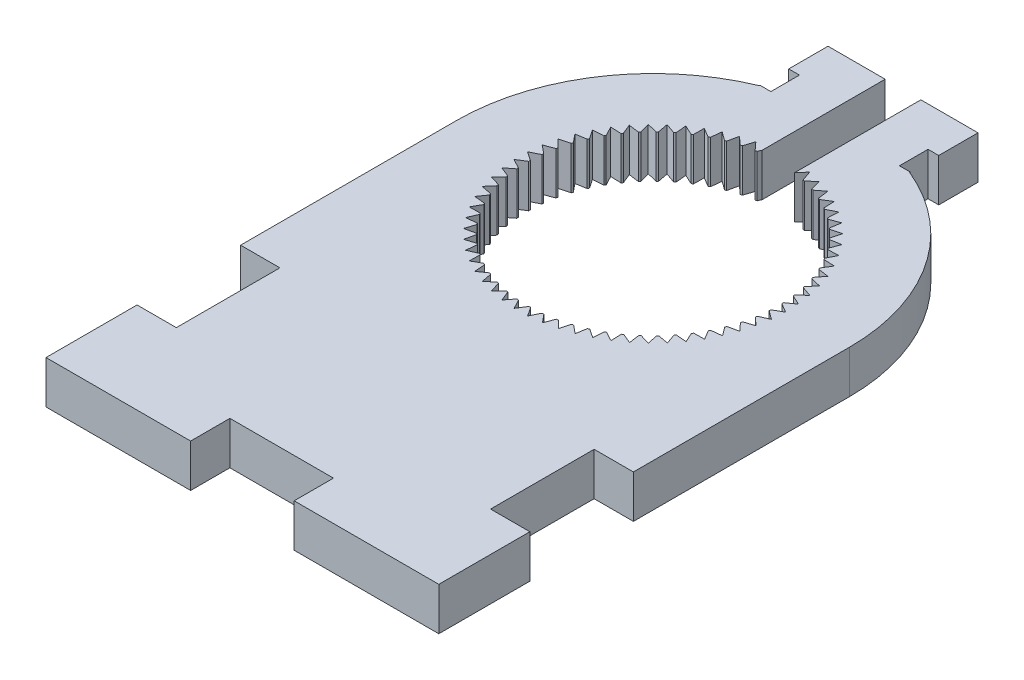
from build123d import *

# Parameters (mm, degrees)
BOSS_EXTRUDE1_DEPTH = 3
CUT_EXTRUDE1_DEPTH  = 6
CIRPATTERN1_COUNT   = 63
SKETCH3_W           = 14.5
SKETCH3_H           = 11
SKETCH3_W_2         = 11
SKETCH3_H_2         = 14.5
CUT_EXTRUDE2_DEPTH  = 6


with BuildPart() as part:
    # Sketch1 → Boss-Extrude1 (new, symmetric)
    with BuildSketch(Plane(origin=(0, 0, 0), x_dir=(1, 0, 0), z_dir=(0, 1, 0))):
        with BuildLine():
            Line((-27.5, 0), (-27.5, -57.5))
            Line((-27.5, -57.5), (27.5, -57.5))
            Line((27.5, -57.5), (27.5, 0))
            ThreePointArc((27.5, 0), (22.858258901, 15.288884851), (10.5, 25.416530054))
            Line((10.5, 25.416530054), (10.5, 25.5))
            Line((10.5, 25.5), (9, 25.5))
            Line((9, 25.5), (9, 29.5))
            Line((9, 29.5), (10.5, 29.5))
            Line((10.5, 29.5), (10.5, 35))
            Line((10.5, 35), (2.5, 35))
            Line((2.5, 35), (2.5, 17.320508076))
            ThreePointArc((2.5, 17.320508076), (0, -17.5), (-2.5, 17.320508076))
            Line((-2.5, 17.320508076), (-2.5, 35))
            Line((-2.5, 35), (-10.5, 35))
            Line((-10.5, 35), (-10.5, 29.5))
            Line((-10.5, 29.5), (-9, 29.5))
            Line((-9, 29.5), (-9, 25.5))
            Line((-9, 25.5), (-10.5, 25.5))
            Line((-10.5, 25.5), (-10.5, 25.416530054))
            ThreePointArc((-10.5, 25.416530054), (-22.858258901, 15.288884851), (-27.5, 0))
        make_face()
    extrude(amount=BOSS_EXTRUDE1_DEPTH, both=True)

    # Sketch2 → Cut-Extrude1 (cut)
    with BuildSketch(Plane(origin=(0, 3, 0), x_dir=(1, 0, 0), z_dir=(0, 1, 0))):
        Polygon((2.5, 17.320508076), (3.974067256, 17.042792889), (3.477542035, 18.458230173), align=None)
    cut_extrude1 = extrude(amount=-CUT_EXTRUDE1_DEPTH, mode=Mode.SUBTRACT)

    # CirPattern1: Cut-Extrude1 ×63 about axis
    cirpattern1_axis = Axis((0, 0, 0), (0, 1, 0))
    for i in range(1, CIRPATTERN1_COUNT):
        add(cut_extrude1.rotate(cirpattern1_axis, i * 360 / CIRPATTERN1_COUNT), mode=Mode.SUBTRACT)

    # Sketch3 → Cut-Extrude2 (cut)
    with BuildSketch(Plane(origin=(0, 3, 0), x_dir=(1, 0, 0), z_dir=(0, 1, 0))):
        with Locations((0, -57.5)):
            Rectangle(SKETCH3_W, SKETCH3_H)
        with Locations((-27.5, -37.5)):
            Rectangle(SKETCH3_W_2, SKETCH3_H_2)
        with Locations((27.5, -37.5)):
            Rectangle(SKETCH3_W_2, SKETCH3_H_2)
    extrude(amount=-CUT_EXTRUDE2_DEPTH, mode=Mode.SUBTRACT)


solid = part.part
